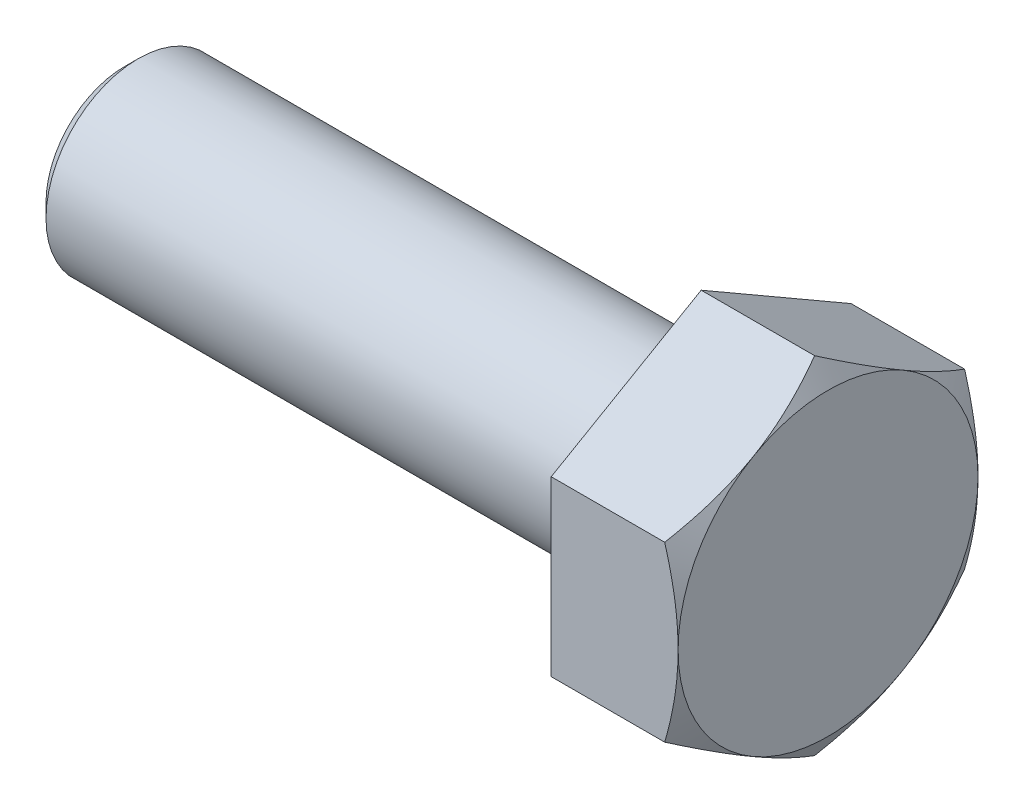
from build123d import *

# Parameters (mm, degrees)
ESQUISSE1_W            = 25
ESQUISSE1_H            = 4
CHANFREIN_DE_TIGE_SIZE = 0.6
T_TE_DEPTH             = 5.5


with BuildPart() as part:
    # Esquisse1 → Tige (revolve)
    with BuildSketch(Plane.XY, mode=Mode.PRIVATE) as tige_sk:
        with Locations((-12.5, 2)):
            Rectangle(ESQUISSE1_W, ESQUISSE1_H)
    revolve(tige_sk.sketch.rotate(Axis((-110, 0, 0), (1, 0, 0)), 90), axis=Axis((-110, 0, 0), (1, 0, 0)))

    # Chanfrein de tige
    chanfrein_de_tige_edges = [part.edges().sort_by_distance(p)[0] for p in [
        (-25, 0, -4),
    ]]
    chamfer(chanfrein_de_tige_edges, length=CHANFREIN_DE_TIGE_SIZE)

    # Esquisse2 → T_te (add)
    with BuildSketch(Plane(origin=(0, 0, 0), x_dir=(0, 0, -1), z_dir=(1, 0, 0))):
        Polygon((0, 7.505553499), (6.5, 3.75277675), (6.5, -3.75277675), (0, -7.505553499), (-6.5, -3.75277675), (-6.5, 3.75277675), align=None)
    extrude(amount=T_TE_DEPTH)

    # Esquisse4 → Chanfrein de t_te (revolve, cut)
    with BuildSketch(Plane.XY):
        Polygon((4.919443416, 7.505553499), (5.5, 7.505553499), (5.5, 6.5), align=None)
    revolve(axis=Axis((16, 0, 0), (-1, 0, 0)), mode=Mode.SUBTRACT)


solid = part.part
